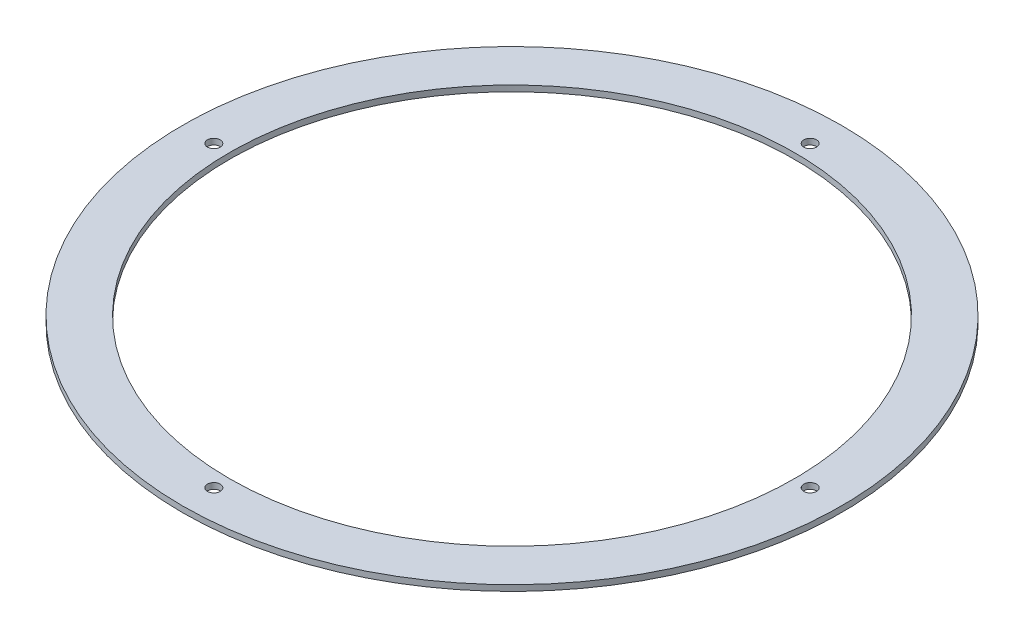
ISO-10303-21;
HEADER;
FILE_DESCRIPTION(('STEP AP214'),'2;1');
FILE_NAME('part.step','',(''),(''),'','','');
FILE_SCHEMA(('AUTOMOTIVE_DESIGN { 1 0 10303 214 1 1 1 1 }'));
ENDSEC;
DATA;
#1=APPLICATION_CONTEXT('core data for automotive mechanical design processes');
#2=APPLICATION_PROTOCOL_DEFINITION('international standard','automotive_design',2000,#1);
#3=PRODUCT_CONTEXT('',#1,'mechanical');
#4=PRODUCT('Part','Part','',(#3));
#5=PRODUCT_RELATED_PRODUCT_CATEGORY('part','',(#4));
#6=PRODUCT_DEFINITION_FORMATION('','',#4);
#7=PRODUCT_DEFINITION_CONTEXT('part definition',#1,'design');
#8=PRODUCT_DEFINITION('design','',#6,#7);
#9=PRODUCT_DEFINITION_SHAPE('','',#8);
#10=(LENGTH_UNIT() NAMED_UNIT(*) SI_UNIT(.MILLI.,.METRE.));
#11=(NAMED_UNIT(*) PLANE_ANGLE_UNIT() SI_UNIT($,.RADIAN.));
#12=(NAMED_UNIT(*) SI_UNIT($,.STERADIAN.) SOLID_ANGLE_UNIT());
#13=UNCERTAINTY_MEASURE_WITH_UNIT(LENGTH_MEASURE(1.E-05),#10,'distance_accuracy_value','');
#14=(GEOMETRIC_REPRESENTATION_CONTEXT(3) GLOBAL_UNCERTAINTY_ASSIGNED_CONTEXT((#13)) GLOBAL_UNIT_ASSIGNED_CONTEXT((#10,
#11,#12)) REPRESENTATION_CONTEXT('',''));
#15=CARTESIAN_POINT('',(0.,0.,0.));
#16=DIRECTION('',(0.,0.,1.));
#17=DIRECTION('',(1.,0.,0.));
#18=AXIS2_PLACEMENT_3D('',#15,#16,#17);
#19=CARTESIAN_POINT('',(0.,-9.525,0.));
#20=DIRECTION('',(0.,1.,0.));
#21=DIRECTION('',(0.,0.,1.));
#22=AXIS2_PLACEMENT_3D('',#19,#20,#21);
#23=CYLINDRICAL_SURFACE('',#22,533.4);
#24=CARTESIAN_POINT('',(0.,-9.525,0.));
#25=DIRECTION('',(0.,1.,0.));
#26=DIRECTION('',(0.,0.,1.));
#27=AXIS2_PLACEMENT_3D('',#24,#25,#26);
#28=CIRCLE('',#27,533.4);
#29=CARTESIAN_POINT('',(0.,-9.525,533.4));
#30=VERTEX_POINT('',#29);
#31=EDGE_CURVE('E10',#30,#30,#28,.T.);
#32=CARTESIAN_POINT('',(0.,0.,0.));
#33=DIRECTION('',(0.,1.,0.));
#34=DIRECTION('',(0.,0.,1.));
#35=AXIS2_PLACEMENT_3D('',#32,#33,#34);
#36=CIRCLE('',#35,533.4);
#37=CARTESIAN_POINT('',(0.,0.,533.4));
#38=VERTEX_POINT('',#37);
#39=EDGE_CURVE('E35',#38,#38,#36,.T.);
#40=CARTESIAN_POINT('',(0.,-9.525,533.4));
#41=CARTESIAN_POINT('',(0.,-9.42578125,533.4));
#42=CARTESIAN_POINT('',(0.,-9.3265625,533.4));
#43=CARTESIAN_POINT('',(0.,-9.128125,533.4));
#44=CARTESIAN_POINT('',(0.,-9.02890625,533.4));
#45=CARTESIAN_POINT('',(0.,-8.83046875,533.4));
#46=CARTESIAN_POINT('',(0.,-8.73125,533.4));
#47=CARTESIAN_POINT('',(0.,-8.5328125,533.4));
#48=CARTESIAN_POINT('',(0.,-8.43359375,533.4));
#49=CARTESIAN_POINT('',(0.,-8.23515625,533.4));
#50=CARTESIAN_POINT('',(0.,-8.1359375,533.4));
#51=CARTESIAN_POINT('',(0.,-7.9375,533.4));
#52=CARTESIAN_POINT('',(0.,-7.83828125,533.4));
#53=CARTESIAN_POINT('',(0.,-7.63984375,533.4));
#54=CARTESIAN_POINT('',(0.,-7.540625,533.4));
#55=CARTESIAN_POINT('',(0.,-7.3421875,533.4));
#56=CARTESIAN_POINT('',(0.,-7.24296875,533.4));
#57=CARTESIAN_POINT('',(0.,-7.04453125,533.4));
#58=CARTESIAN_POINT('',(0.,-6.9453125,533.4));
#59=CARTESIAN_POINT('',(0.,-6.746875,533.4));
#60=CARTESIAN_POINT('',(0.,-6.64765625,533.4));
#61=CARTESIAN_POINT('',(0.,-6.44921875,533.4));
#62=CARTESIAN_POINT('',(0.,-6.35,533.4));
#63=CARTESIAN_POINT('',(0.,-6.1515625,533.4));
#64=CARTESIAN_POINT('',(0.,-6.05234375,533.4));
#65=CARTESIAN_POINT('',(0.,-5.85390625,533.4));
#66=CARTESIAN_POINT('',(0.,-5.7546875,533.4));
#67=CARTESIAN_POINT('',(0.,-5.55625,533.4));
#68=CARTESIAN_POINT('',(0.,-5.45703125,533.4));
#69=CARTESIAN_POINT('',(0.,-5.25859375,533.4));
#70=CARTESIAN_POINT('',(0.,-5.159375,533.4));
#71=CARTESIAN_POINT('',(0.,-4.9609375,533.4));
#72=CARTESIAN_POINT('',(0.,-4.86171875,533.4));
#73=CARTESIAN_POINT('',(0.,-4.66328125,533.4));
#74=CARTESIAN_POINT('',(0.,-4.5640625,533.4));
#75=CARTESIAN_POINT('',(0.,-4.365625,533.4));
#76=CARTESIAN_POINT('',(0.,-4.26640625,533.4));
#77=CARTESIAN_POINT('',(0.,-4.06796875,533.4));
#78=CARTESIAN_POINT('',(0.,-3.96875,533.4));
#79=CARTESIAN_POINT('',(0.,-3.7703125,533.4));
#80=CARTESIAN_POINT('',(0.,-3.67109375,533.4));
#81=CARTESIAN_POINT('',(0.,-3.47265625,533.4));
#82=CARTESIAN_POINT('',(0.,-3.3734375,533.4));
#83=CARTESIAN_POINT('',(0.,-3.175,533.4));
#84=CARTESIAN_POINT('',(0.,-3.07578125,533.4));
#85=CARTESIAN_POINT('',(0.,-2.87734375,533.4));
#86=CARTESIAN_POINT('',(0.,-2.778125,533.4));
#87=CARTESIAN_POINT('',(0.,-2.5796875,533.4));
#88=CARTESIAN_POINT('',(0.,-2.48046875,533.4));
#89=CARTESIAN_POINT('',(0.,-2.28203125,533.4));
#90=CARTESIAN_POINT('',(0.,-2.1828125,533.4));
#91=CARTESIAN_POINT('',(0.,-1.984375,533.4));
#92=CARTESIAN_POINT('',(0.,-1.88515625,533.4));
#93=CARTESIAN_POINT('',(0.,-1.68671875,533.4));
#94=CARTESIAN_POINT('',(0.,-1.5875,533.4));
#95=CARTESIAN_POINT('',(0.,-1.3890625,533.4));
#96=CARTESIAN_POINT('',(0.,-1.28984375,533.4));
#97=CARTESIAN_POINT('',(0.,-1.09140625,533.4));
#98=CARTESIAN_POINT('',(0.,-0.992187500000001,533.4));
#99=CARTESIAN_POINT('',(0.,-0.793750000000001,533.4));
#100=CARTESIAN_POINT('',(0.,-0.69453125,533.4));
#101=CARTESIAN_POINT('',(0.,-0.49609375,533.4));
#102=CARTESIAN_POINT('',(0.,-0.396875,533.4));
#103=CARTESIAN_POINT('',(0.,-0.1984375,533.4));
#104=CARTESIAN_POINT('',(0.,-0.0992187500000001,533.4));
#105=CARTESIAN_POINT('',(0.,0.,533.4));
#106=B_SPLINE_CURVE_WITH_KNOTS('',3,(#40,#41,#42,#43,#44,#45,#46,#47,#48,#49,#50,#51,#52,#53,
#54,#55,#56,#57,#58,#59,#60,#61,#62,#63,#64,#65,#66,#67,#68,#69,#70,#71,#72,#73,#74,#75,#76,#77,
#78,#79,#80,#81,#82,#83,#84,#85,#86,#87,#88,#89,#90,#91,#92,#93,#94,#95,#96,#97,#98,#99,#100,
#101,#102,#103,#104,#105),.UNSPECIFIED.,.F.,.F.,(4,2,2,2,2,2,2,2,2,2,2,2,2,2,2,2,2,2,2,2,2,2,2,
2,2,2,2,2,2,2,2,2,4),(0.,0.29765625,0.5953125,0.892968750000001,1.190625,1.48828125,1.7859375,
2.08359375,2.38125,2.67890625,2.9765625,3.27421875,3.571875,3.86953125,4.1671875,4.46484375,
4.7625,5.06015625,5.3578125,5.65546875,5.953125,6.25078125,6.5484375,6.84609375,7.14375,
7.44140625,7.7390625,8.03671875,8.334375,8.63203125,8.9296875,9.22734375,9.525),.UNSPECIFIED.);
#107=EDGE_CURVE('BSEAM29',#30,#38,#106,.T.);
#108=ORIENTED_EDGE('',*,*,#31,.T.);
#109=ORIENTED_EDGE('',*,*,#39,.F.);
#110=ORIENTED_EDGE('',*,*,#107,.T.);
#111=ORIENTED_EDGE('',*,*,#107,.F.);
#112=EDGE_LOOP('',(#108,#110,#109,#111));
#113=FACE_BOUND('',#112,.T.);
#114=ADVANCED_FACE('F29',(#113),#23,.T.);
#115=CARTESIAN_POINT('',(0.,-9.525,0.));
#116=DIRECTION('',(0.,1.,0.));
#117=DIRECTION('',(0.,0.,1.));
#118=AXIS2_PLACEMENT_3D('',#115,#116,#117);
#119=PLANE('',#118);
#120=CARTESIAN_POINT('',(482.6,-9.525,-5.05496961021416E-12));
#121=DIRECTION('',(0.,1.,0.));
#122=DIRECTION('',(-1.,0.,0.));
#123=AXIS2_PLACEMENT_3D('',#120,#121,#122);
#124=CIRCLE('',#123,10.3124);
#125=CARTESIAN_POINT('',(482.6,-9.525,10.3123999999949));
#126=VERTEX_POINT('',#125);
#127=EDGE_CURVE('E66',#126,#126,#124,.T.);
#128=ORIENTED_EDGE('',*,*,#127,.T.);
#129=EDGE_LOOP('',(#128));
#130=FACE_BOUND('',#129,.T.);
#131=CARTESIAN_POINT('',(3.36997974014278E-12,-9.525,482.6));
#132=DIRECTION('',(0.,1.,0.));
#133=DIRECTION('',(0.,0.,-1.));
#134=AXIS2_PLACEMENT_3D('',#131,#132,#133);
#135=CIRCLE('',#134,10.3124);
#136=CARTESIAN_POINT('',(3.36997974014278E-12,-9.525,492.9124));
#137=VERTEX_POINT('',#136);
#138=EDGE_CURVE('E60',#137,#137,#135,.T.);
#139=ORIENTED_EDGE('',*,*,#138,.T.);
#140=EDGE_LOOP('',(#139));
#141=FACE_BOUND('',#140,.T.);
#142=CARTESIAN_POINT('',(-482.6,-9.525,1.68498987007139E-12));
#143=DIRECTION('',(0.,1.,0.));
#144=DIRECTION('',(1.,0.,0.));
#145=AXIS2_PLACEMENT_3D('',#142,#143,#144);
#146=CIRCLE('',#145,10.3124);
#147=CARTESIAN_POINT('',(-482.6,-9.525,10.3124000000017));
#148=VERTEX_POINT('',#147);
#149=EDGE_CURVE('E54',#148,#148,#146,.T.);
#150=ORIENTED_EDGE('',*,*,#149,.T.);
#151=EDGE_LOOP('',(#150));
#152=FACE_BOUND('',#151,.T.);
#153=CARTESIAN_POINT('',(0.,-9.525,-482.6));
#154=DIRECTION('',(0.,1.,0.));
#155=DIRECTION('',(0.,0.,1.));
#156=AXIS2_PLACEMENT_3D('',#153,#154,#155);
#157=CIRCLE('',#156,10.3124);
#158=CARTESIAN_POINT('',(0.,-9.525,-472.2876));
#159=VERTEX_POINT('',#158);
#160=EDGE_CURVE('E48',#159,#159,#157,.T.);
#161=ORIENTED_EDGE('',*,*,#160,.T.);
#162=EDGE_LOOP('',(#161));
#163=FACE_BOUND('',#162,.T.);
#164=CARTESIAN_POINT('',(0.,-9.525,0.));
#165=DIRECTION('',(0.,1.,0.));
#166=DIRECTION('',(0.,0.,1.));
#167=AXIS2_PLACEMENT_3D('',#164,#165,#166);
#168=CIRCLE('',#167,457.2);
#169=CARTESIAN_POINT('',(0.,-9.525,457.2));
#170=VERTEX_POINT('',#169);
#171=EDGE_CURVE('E39',#170,#170,#168,.T.);
#172=ORIENTED_EDGE('',*,*,#171,.T.);
#173=EDGE_LOOP('',(#172));
#174=FACE_BOUND('',#173,.T.);
#175=ORIENTED_EDGE('',*,*,#31,.F.);
#176=EDGE_LOOP('',(#175));
#177=FACE_BOUND('',#176,.T.);
#178=ADVANCED_FACE('F79',(#130,#141,#152,#163,#174,#177),#119,.F.);
#179=CARTESIAN_POINT('',(0.,0.,0.));
#180=DIRECTION('',(0.,1.,0.));
#181=DIRECTION('',(0.,0.,1.));
#182=AXIS2_PLACEMENT_3D('',#179,#180,#181);
#183=PLANE('',#182);
#184=CARTESIAN_POINT('',(482.6,0.,-5.05496961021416E-12));
#185=DIRECTION('',(0.,1.,0.));
#186=DIRECTION('',(-1.,0.,0.));
#187=AXIS2_PLACEMENT_3D('',#184,#185,#186);
#188=CIRCLE('',#187,10.3124);
#189=CARTESIAN_POINT('',(482.6,0.,10.3123999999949));
#190=VERTEX_POINT('',#189);
#191=EDGE_CURVE('E69',#190,#190,#188,.T.);
#192=ORIENTED_EDGE('',*,*,#191,.F.);
#193=EDGE_LOOP('',(#192));
#194=FACE_BOUND('',#193,.T.);
#195=CARTESIAN_POINT('',(3.36997974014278E-12,0.,482.6));
#196=DIRECTION('',(0.,1.,0.));
#197=DIRECTION('',(0.,0.,-1.));
#198=AXIS2_PLACEMENT_3D('',#195,#196,#197);
#199=CIRCLE('',#198,10.3124);
#200=CARTESIAN_POINT('',(3.36997974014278E-12,0.,492.9124));
#201=VERTEX_POINT('',#200);
#202=EDGE_CURVE('E63',#201,#201,#199,.T.);
#203=ORIENTED_EDGE('',*,*,#202,.F.);
#204=EDGE_LOOP('',(#203));
#205=FACE_BOUND('',#204,.T.);
#206=CARTESIAN_POINT('',(-482.6,0.,1.68498987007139E-12));
#207=DIRECTION('',(0.,1.,0.));
#208=DIRECTION('',(1.,0.,0.));
#209=AXIS2_PLACEMENT_3D('',#206,#207,#208);
#210=CIRCLE('',#209,10.3124);
#211=CARTESIAN_POINT('',(-482.6,0.,10.3124000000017));
#212=VERTEX_POINT('',#211);
#213=EDGE_CURVE('E57',#212,#212,#210,.T.);
#214=ORIENTED_EDGE('',*,*,#213,.F.);
#215=EDGE_LOOP('',(#214));
#216=FACE_BOUND('',#215,.T.);
#217=CARTESIAN_POINT('',(0.,0.,-482.6));
#218=DIRECTION('',(0.,1.,0.));
#219=DIRECTION('',(0.,0.,1.));
#220=AXIS2_PLACEMENT_3D('',#217,#218,#219);
#221=CIRCLE('',#220,10.3124);
#222=CARTESIAN_POINT('',(0.,0.,-472.2876));
#223=VERTEX_POINT('',#222);
#224=EDGE_CURVE('E51',#223,#223,#221,.T.);
#225=ORIENTED_EDGE('',*,*,#224,.F.);
#226=EDGE_LOOP('',(#225));
#227=FACE_BOUND('',#226,.T.);
#228=CARTESIAN_POINT('',(0.,0.,0.));
#229=DIRECTION('',(0.,1.,0.));
#230=DIRECTION('',(0.,0.,1.));
#231=AXIS2_PLACEMENT_3D('',#228,#229,#230);
#232=CIRCLE('',#231,457.2);
#233=CARTESIAN_POINT('',(0.,0.,457.2));
#234=VERTEX_POINT('',#233);
#235=EDGE_CURVE('E43',#234,#234,#232,.T.);
#236=ORIENTED_EDGE('',*,*,#235,.F.);
#237=EDGE_LOOP('',(#236));
#238=FACE_BOUND('',#237,.T.);
#239=ORIENTED_EDGE('',*,*,#39,.T.);
#240=EDGE_LOOP('',(#239));
#241=FACE_BOUND('',#240,.T.);
#242=ADVANCED_FACE('F75',(#194,#205,#216,#227,#238,#241),#183,.T.);
#243=CARTESIAN_POINT('',(0.,-9.525,0.));
#244=DIRECTION('',(0.,1.,0.));
#245=DIRECTION('',(0.,0.,1.));
#246=AXIS2_PLACEMENT_3D('',#243,#244,#245);
#247=CYLINDRICAL_SURFACE('',#246,457.2);
#248=CARTESIAN_POINT('',(0.,-9.525,457.2));
#249=CARTESIAN_POINT('',(0.,-9.42578125,457.2));
#250=CARTESIAN_POINT('',(0.,-9.3265625,457.2));
#251=CARTESIAN_POINT('',(0.,-9.128125,457.2));
#252=CARTESIAN_POINT('',(0.,-9.02890625,457.2));
#253=CARTESIAN_POINT('',(0.,-8.83046875,457.2));
#254=CARTESIAN_POINT('',(0.,-8.73125,457.2));
#255=CARTESIAN_POINT('',(0.,-8.5328125,457.2));
#256=CARTESIAN_POINT('',(0.,-8.43359375,457.2));
#257=CARTESIAN_POINT('',(0.,-8.23515625,457.2));
#258=CARTESIAN_POINT('',(0.,-8.1359375,457.2));
#259=CARTESIAN_POINT('',(0.,-7.9375,457.2));
#260=CARTESIAN_POINT('',(0.,-7.83828125,457.2));
#261=CARTESIAN_POINT('',(0.,-7.63984375,457.2));
#262=CARTESIAN_POINT('',(0.,-7.540625,457.2));
#263=CARTESIAN_POINT('',(0.,-7.3421875,457.2));
#264=CARTESIAN_POINT('',(0.,-7.24296875,457.2));
#265=CARTESIAN_POINT('',(0.,-7.04453125,457.2));
#266=CARTESIAN_POINT('',(0.,-6.9453125,457.2));
#267=CARTESIAN_POINT('',(0.,-6.746875,457.2));
#268=CARTESIAN_POINT('',(0.,-6.64765625,457.2));
#269=CARTESIAN_POINT('',(0.,-6.44921875,457.2));
#270=CARTESIAN_POINT('',(0.,-6.35,457.2));
#271=CARTESIAN_POINT('',(0.,-6.1515625,457.2));
#272=CARTESIAN_POINT('',(0.,-6.05234375,457.2));
#273=CARTESIAN_POINT('',(0.,-5.85390625,457.2));
#274=CARTESIAN_POINT('',(0.,-5.7546875,457.2));
#275=CARTESIAN_POINT('',(0.,-5.55625,457.2));
#276=CARTESIAN_POINT('',(0.,-5.45703125,457.2));
#277=CARTESIAN_POINT('',(0.,-5.25859375,457.2));
#278=CARTESIAN_POINT('',(0.,-5.159375,457.2));
#279=CARTESIAN_POINT('',(0.,-4.9609375,457.2));
#280=CARTESIAN_POINT('',(0.,-4.86171875,457.2));
#281=CARTESIAN_POINT('',(0.,-4.66328125,457.2));
#282=CARTESIAN_POINT('',(0.,-4.5640625,457.2));
#283=CARTESIAN_POINT('',(0.,-4.365625,457.2));
#284=CARTESIAN_POINT('',(0.,-4.26640625,457.2));
#285=CARTESIAN_POINT('',(0.,-4.06796875,457.2));
#286=CARTESIAN_POINT('',(0.,-3.96875,457.2));
#287=CARTESIAN_POINT('',(0.,-3.7703125,457.2));
#288=CARTESIAN_POINT('',(0.,-3.67109375,457.2));
#289=CARTESIAN_POINT('',(0.,-3.47265625,457.2));
#290=CARTESIAN_POINT('',(0.,-3.3734375,457.2));
#291=CARTESIAN_POINT('',(0.,-3.175,457.2));
#292=CARTESIAN_POINT('',(0.,-3.07578125,457.2));
#293=CARTESIAN_POINT('',(0.,-2.87734375,457.2));
#294=CARTESIAN_POINT('',(0.,-2.778125,457.2));
#295=CARTESIAN_POINT('',(0.,-2.5796875,457.2));
#296=CARTESIAN_POINT('',(0.,-2.48046875,457.2));
#297=CARTESIAN_POINT('',(0.,-2.28203125,457.2));
#298=CARTESIAN_POINT('',(0.,-2.1828125,457.2));
#299=CARTESIAN_POINT('',(0.,-1.984375,457.2));
#300=CARTESIAN_POINT('',(0.,-1.88515625,457.2));
#301=CARTESIAN_POINT('',(0.,-1.68671875,457.2));
#302=CARTESIAN_POINT('',(0.,-1.5875,457.2));
#303=CARTESIAN_POINT('',(0.,-1.3890625,457.2));
#304=CARTESIAN_POINT('',(0.,-1.28984375,457.2));
#305=CARTESIAN_POINT('',(0.,-1.09140625,457.2));
#306=CARTESIAN_POINT('',(0.,-0.992187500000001,457.2));
#307=CARTESIAN_POINT('',(0.,-0.793750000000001,457.2));
#308=CARTESIAN_POINT('',(0.,-0.69453125,457.2));
#309=CARTESIAN_POINT('',(0.,-0.49609375,457.2));
#310=CARTESIAN_POINT('',(0.,-0.396875,457.2));
#311=CARTESIAN_POINT('',(0.,-0.1984375,457.2));
#312=CARTESIAN_POINT('',(0.,-0.0992187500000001,457.2));
#313=CARTESIAN_POINT('',(0.,0.,457.2));
#314=B_SPLINE_CURVE_WITH_KNOTS('',3,(#248,#249,#250,#251,#252,#253,#254,#255,#256,#257,#258,
#259,#260,#261,#262,#263,#264,#265,#266,#267,#268,#269,#270,#271,#272,#273,#274,#275,#276,#277,
#278,#279,#280,#281,#282,#283,#284,#285,#286,#287,#288,#289,#290,#291,#292,#293,#294,#295,#296,
#297,#298,#299,#300,#301,#302,#303,#304,#305,#306,#307,#308,#309,#310,#311,#312,#313),
.UNSPECIFIED.,.F.,.F.,(4,2,2,2,2,2,2,2,2,2,2,2,2,2,2,2,2,2,2,2,2,2,2,2,2,2,2,2,2,2,2,2,4),(0.,
0.297656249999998,0.595312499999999,0.892968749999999,1.190625,1.48828125,1.7859375,2.08359375,
2.38125,2.67890625,2.9765625,3.27421875,3.571875,3.86953125,4.1671875,4.46484375,4.7625,
5.06015625,5.3578125,5.65546875,5.953125,6.25078125,6.5484375,6.84609375,7.14375,7.44140625,
7.7390625,8.03671875,8.334375,8.63203125,8.9296875,9.22734375,9.525),.UNSPECIFIED.);
#315=EDGE_CURVE('BSEAM78',#170,#234,#314,.T.);
#316=ORIENTED_EDGE('',*,*,#171,.F.);
#317=ORIENTED_EDGE('',*,*,#235,.T.);
#318=ORIENTED_EDGE('',*,*,#315,.T.);
#319=ORIENTED_EDGE('',*,*,#315,.F.);
#320=EDGE_LOOP('',(#316,#318,#317,#319));
#321=FACE_BOUND('',#320,.T.);
#322=ADVANCED_FACE('F78',(#321),#247,.F.);
#323=CARTESIAN_POINT('',(0.,-9.525,-482.6));
#324=DIRECTION('',(0.,1.,0.));
#325=DIRECTION('',(0.,0.,1.));
#326=AXIS2_PLACEMENT_3D('',#323,#324,#325);
#327=CYLINDRICAL_SURFACE('',#326,10.3124);
#328=CARTESIAN_POINT('',(0.,-9.525,-472.2876));
#329=CARTESIAN_POINT('',(0.,-9.42578125,-472.2876));
#330=CARTESIAN_POINT('',(0.,-9.3265625,-472.2876));
#331=CARTESIAN_POINT('',(0.,-9.128125,-472.2876));
#332=CARTESIAN_POINT('',(0.,-9.02890625,-472.2876));
#333=CARTESIAN_POINT('',(0.,-8.83046875,-472.2876));
#334=CARTESIAN_POINT('',(0.,-8.73125,-472.2876));
#335=CARTESIAN_POINT('',(0.,-8.5328125,-472.2876));
#336=CARTESIAN_POINT('',(0.,-8.43359375,-472.2876));
#337=CARTESIAN_POINT('',(0.,-8.23515625,-472.2876));
#338=CARTESIAN_POINT('',(0.,-8.1359375,-472.2876));
#339=CARTESIAN_POINT('',(0.,-7.9375,-472.2876));
#340=CARTESIAN_POINT('',(0.,-7.83828125,-472.2876));
#341=CARTESIAN_POINT('',(0.,-7.63984375,-472.2876));
#342=CARTESIAN_POINT('',(0.,-7.540625,-472.2876));
#343=CARTESIAN_POINT('',(0.,-7.3421875,-472.2876));
#344=CARTESIAN_POINT('',(0.,-7.24296875,-472.2876));
#345=CARTESIAN_POINT('',(0.,-7.04453125,-472.2876));
#346=CARTESIAN_POINT('',(0.,-6.9453125,-472.2876));
#347=CARTESIAN_POINT('',(0.,-6.746875,-472.2876));
#348=CARTESIAN_POINT('',(0.,-6.64765625,-472.2876));
#349=CARTESIAN_POINT('',(0.,-6.44921875,-472.2876));
#350=CARTESIAN_POINT('',(0.,-6.35,-472.2876));
#351=CARTESIAN_POINT('',(0.,-6.1515625,-472.2876));
#352=CARTESIAN_POINT('',(0.,-6.05234375,-472.2876));
#353=CARTESIAN_POINT('',(0.,-5.85390625,-472.2876));
#354=CARTESIAN_POINT('',(0.,-5.7546875,-472.2876));
#355=CARTESIAN_POINT('',(0.,-5.55625,-472.2876));
#356=CARTESIAN_POINT('',(0.,-5.45703125,-472.2876));
#357=CARTESIAN_POINT('',(0.,-5.25859375,-472.2876));
#358=CARTESIAN_POINT('',(0.,-5.159375,-472.2876));
#359=CARTESIAN_POINT('',(0.,-4.9609375,-472.2876));
#360=CARTESIAN_POINT('',(0.,-4.86171875,-472.2876));
#361=CARTESIAN_POINT('',(0.,-4.66328125,-472.2876));
#362=CARTESIAN_POINT('',(0.,-4.5640625,-472.2876));
#363=CARTESIAN_POINT('',(0.,-4.365625,-472.2876));
#364=CARTESIAN_POINT('',(0.,-4.26640625,-472.2876));
#365=CARTESIAN_POINT('',(0.,-4.06796875,-472.2876));
#366=CARTESIAN_POINT('',(0.,-3.96875,-472.2876));
#367=CARTESIAN_POINT('',(0.,-3.7703125,-472.2876));
#368=CARTESIAN_POINT('',(0.,-3.67109375,-472.2876));
#369=CARTESIAN_POINT('',(0.,-3.47265625,-472.2876));
#370=CARTESIAN_POINT('',(0.,-3.3734375,-472.2876));
#371=CARTESIAN_POINT('',(0.,-3.175,-472.2876));
#372=CARTESIAN_POINT('',(0.,-3.07578125,-472.2876));
#373=CARTESIAN_POINT('',(0.,-2.87734375,-472.2876));
#374=CARTESIAN_POINT('',(0.,-2.778125,-472.2876));
#375=CARTESIAN_POINT('',(0.,-2.5796875,-472.2876));
#376=CARTESIAN_POINT('',(0.,-2.48046875,-472.2876));
#377=CARTESIAN_POINT('',(0.,-2.28203125,-472.2876));
#378=CARTESIAN_POINT('',(0.,-2.1828125,-472.2876));
#379=CARTESIAN_POINT('',(0.,-1.984375,-472.2876));
#380=CARTESIAN_POINT('',(0.,-1.88515625,-472.2876));
#381=CARTESIAN_POINT('',(0.,-1.68671875,-472.2876));
#382=CARTESIAN_POINT('',(0.,-1.5875,-472.2876));
#383=CARTESIAN_POINT('',(0.,-1.3890625,-472.2876));
#384=CARTESIAN_POINT('',(0.,-1.28984375,-472.2876));
#385=CARTESIAN_POINT('',(0.,-1.09140625,-472.2876));
#386=CARTESIAN_POINT('',(0.,-0.992187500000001,-472.2876));
#387=CARTESIAN_POINT('',(0.,-0.793750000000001,-472.2876));
#388=CARTESIAN_POINT('',(0.,-0.69453125,-472.2876));
#389=CARTESIAN_POINT('',(0.,-0.49609375,-472.2876));
#390=CARTESIAN_POINT('',(0.,-0.396875,-472.2876));
#391=CARTESIAN_POINT('',(0.,-0.1984375,-472.2876));
#392=CARTESIAN_POINT('',(0.,-0.0992187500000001,-472.2876));
#393=CARTESIAN_POINT('',(0.,0.,-472.2876));
#394=B_SPLINE_CURVE_WITH_KNOTS('',3,(#328,#329,#330,#331,#332,#333,#334,#335,#336,#337,#338,
#339,#340,#341,#342,#343,#344,#345,#346,#347,#348,#349,#350,#351,#352,#353,#354,#355,#356,#357,
#358,#359,#360,#361,#362,#363,#364,#365,#366,#367,#368,#369,#370,#371,#372,#373,#374,#375,#376,
#377,#378,#379,#380,#381,#382,#383,#384,#385,#386,#387,#388,#389,#390,#391,#392,#393),
.UNSPECIFIED.,.F.,.F.,(4,2,2,2,2,2,2,2,2,2,2,2,2,2,2,2,2,2,2,2,2,2,2,2,2,2,2,2,2,2,2,2,4),(0.,
0.29765625,0.5953125,0.892968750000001,1.190625,1.48828125,1.7859375,2.08359375,2.38125,
2.67890625,2.9765625,3.27421875,3.571875,3.86953125,4.1671875,4.46484375,4.7625,5.06015625,
5.3578125,5.65546875,5.953125,6.25078125,6.5484375,6.84609375,7.14375,7.44140625,7.7390625,
8.03671875,8.334375,8.63203125,8.9296875,9.22734375,9.525),.UNSPECIFIED.);
#395=EDGE_CURVE('BSEAM90',#159,#223,#394,.T.);
#396=ORIENTED_EDGE('',*,*,#160,.F.);
#397=ORIENTED_EDGE('',*,*,#224,.T.);
#398=ORIENTED_EDGE('',*,*,#395,.T.);
#399=ORIENTED_EDGE('',*,*,#395,.F.);
#400=EDGE_LOOP('',(#396,#398,#397,#399));
#401=FACE_BOUND('',#400,.T.);
#402=ADVANCED_FACE('F90',(#401),#327,.F.);
#403=CARTESIAN_POINT('',(-482.6,-9.525,1.68498987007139E-12));
#404=DIRECTION('',(0.,1.,0.));
#405=DIRECTION('',(0.,0.,1.));
#406=AXIS2_PLACEMENT_3D('',#403,#404,#405);
#407=CYLINDRICAL_SURFACE('',#406,10.3124);
#408=CARTESIAN_POINT('',(-482.6,-9.525,10.3124000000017));
#409=CARTESIAN_POINT('',(-482.6,-9.42578125,10.3124000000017));
#410=CARTESIAN_POINT('',(-482.6,-9.3265625,10.3124000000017));
#411=CARTESIAN_POINT('',(-482.6,-9.128125,10.3124000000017));
#412=CARTESIAN_POINT('',(-482.6,-9.02890625,10.3124000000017));
#413=CARTESIAN_POINT('',(-482.6,-8.83046875,10.3124000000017));
#414=CARTESIAN_POINT('',(-482.6,-8.73125,10.3124000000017));
#415=CARTESIAN_POINT('',(-482.6,-8.5328125,10.3124000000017));
#416=CARTESIAN_POINT('',(-482.6,-8.43359375,10.3124000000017));
#417=CARTESIAN_POINT('',(-482.6,-8.23515625,10.3124000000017));
#418=CARTESIAN_POINT('',(-482.6,-8.1359375,10.3124000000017));
#419=CARTESIAN_POINT('',(-482.6,-7.9375,10.3124000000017));
#420=CARTESIAN_POINT('',(-482.6,-7.83828125,10.3124000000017));
#421=CARTESIAN_POINT('',(-482.6,-7.63984375,10.3124000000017));
#422=CARTESIAN_POINT('',(-482.6,-7.540625,10.3124000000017));
#423=CARTESIAN_POINT('',(-482.6,-7.3421875,10.3124000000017));
#424=CARTESIAN_POINT('',(-482.6,-7.24296875,10.3124000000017));
#425=CARTESIAN_POINT('',(-482.6,-7.04453125,10.3124000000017));
#426=CARTESIAN_POINT('',(-482.6,-6.9453125,10.3124000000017));
#427=CARTESIAN_POINT('',(-482.6,-6.746875,10.3124000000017));
#428=CARTESIAN_POINT('',(-482.6,-6.64765625,10.3124000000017));
#429=CARTESIAN_POINT('',(-482.6,-6.44921875,10.3124000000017));
#430=CARTESIAN_POINT('',(-482.6,-6.35,10.3124000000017));
#431=CARTESIAN_POINT('',(-482.6,-6.1515625,10.3124000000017));
#432=CARTESIAN_POINT('',(-482.6,-6.05234375,10.3124000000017));
#433=CARTESIAN_POINT('',(-482.6,-5.85390625,10.3124000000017));
#434=CARTESIAN_POINT('',(-482.6,-5.7546875,10.3124000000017));
#435=CARTESIAN_POINT('',(-482.6,-5.55625,10.3124000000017));
#436=CARTESIAN_POINT('',(-482.6,-5.45703125,10.3124000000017));
#437=CARTESIAN_POINT('',(-482.6,-5.25859375,10.3124000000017));
#438=CARTESIAN_POINT('',(-482.6,-5.159375,10.3124000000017));
#439=CARTESIAN_POINT('',(-482.6,-4.9609375,10.3124000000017));
#440=CARTESIAN_POINT('',(-482.6,-4.86171875,10.3124000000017));
#441=CARTESIAN_POINT('',(-482.6,-4.66328125,10.3124000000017));
#442=CARTESIAN_POINT('',(-482.6,-4.5640625,10.3124000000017));
#443=CARTESIAN_POINT('',(-482.6,-4.365625,10.3124000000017));
#444=CARTESIAN_POINT('',(-482.6,-4.26640625,10.3124000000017));
#445=CARTESIAN_POINT('',(-482.6,-4.06796875,10.3124000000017));
#446=CARTESIAN_POINT('',(-482.6,-3.96875,10.3124000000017));
#447=CARTESIAN_POINT('',(-482.6,-3.7703125,10.3124000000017));
#448=CARTESIAN_POINT('',(-482.6,-3.67109375,10.3124000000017));
#449=CARTESIAN_POINT('',(-482.6,-3.47265625,10.3124000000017));
#450=CARTESIAN_POINT('',(-482.6,-3.3734375,10.3124000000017));
#451=CARTESIAN_POINT('',(-482.6,-3.175,10.3124000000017));
#452=CARTESIAN_POINT('',(-482.6,-3.07578125,10.3124000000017));
#453=CARTESIAN_POINT('',(-482.6,-2.87734375,10.3124000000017));
#454=CARTESIAN_POINT('',(-482.6,-2.778125,10.3124000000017));
#455=CARTESIAN_POINT('',(-482.6,-2.5796875,10.3124000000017));
#456=CARTESIAN_POINT('',(-482.6,-2.48046875,10.3124000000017));
#457=CARTESIAN_POINT('',(-482.6,-2.28203125,10.3124000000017));
#458=CARTESIAN_POINT('',(-482.6,-2.1828125,10.3124000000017));
#459=CARTESIAN_POINT('',(-482.6,-1.984375,10.3124000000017));
#460=CARTESIAN_POINT('',(-482.6,-1.88515625,10.3124000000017));
#461=CARTESIAN_POINT('',(-482.6,-1.68671875,10.3124000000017));
#462=CARTESIAN_POINT('',(-482.6,-1.5875,10.3124000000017));
#463=CARTESIAN_POINT('',(-482.6,-1.3890625,10.3124000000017));
#464=CARTESIAN_POINT('',(-482.6,-1.28984375,10.3124000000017));
#465=CARTESIAN_POINT('',(-482.6,-1.09140625,10.3124000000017));
#466=CARTESIAN_POINT('',(-482.6,-0.992187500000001,10.3124000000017));
#467=CARTESIAN_POINT('',(-482.6,-0.793750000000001,10.3124000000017));
#468=CARTESIAN_POINT('',(-482.6,-0.69453125,10.3124000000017));
#469=CARTESIAN_POINT('',(-482.6,-0.49609375,10.3124000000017));
#470=CARTESIAN_POINT('',(-482.6,-0.396875,10.3124000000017));
#471=CARTESIAN_POINT('',(-482.6,-0.1984375,10.3124000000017));
#472=CARTESIAN_POINT('',(-482.6,-0.0992187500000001,10.3124000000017));
#473=CARTESIAN_POINT('',(-482.6,0.,10.3124000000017));
#474=B_SPLINE_CURVE_WITH_KNOTS('',3,(#408,#409,#410,#411,#412,#413,#414,#415,#416,#417,#418,
#419,#420,#421,#422,#423,#424,#425,#426,#427,#428,#429,#430,#431,#432,#433,#434,#435,#436,#437,
#438,#439,#440,#441,#442,#443,#444,#445,#446,#447,#448,#449,#450,#451,#452,#453,#454,#455,#456,
#457,#458,#459,#460,#461,#462,#463,#464,#465,#466,#467,#468,#469,#470,#471,#472,#473),
.UNSPECIFIED.,.F.,.F.,(4,2,2,2,2,2,2,2,2,2,2,2,2,2,2,2,2,2,2,2,2,2,2,2,2,2,2,2,2,2,2,2,4),(0.,
0.29765625,0.5953125,0.892968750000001,1.190625,1.48828125,1.7859375,2.08359375,2.38125,
2.67890625,2.9765625,3.27421875,3.571875,3.86953125,4.1671875,4.46484375,4.7625,5.06015625,
5.3578125,5.65546875,5.953125,6.25078125,6.5484375,6.84609375,7.14375,7.44140625,7.7390625,
8.03671875,8.334375,8.63203125,8.9296875,9.22734375,9.525),.UNSPECIFIED.);
#475=EDGE_CURVE('BSEAM97',#148,#212,#474,.T.);
#476=ORIENTED_EDGE('',*,*,#149,.F.);
#477=ORIENTED_EDGE('',*,*,#213,.T.);
#478=ORIENTED_EDGE('',*,*,#475,.T.);
#479=ORIENTED_EDGE('',*,*,#475,.F.);
#480=EDGE_LOOP('',(#476,#478,#477,#479));
#481=FACE_BOUND('',#480,.T.);
#482=ADVANCED_FACE('F97',(#481),#407,.F.);
#483=CARTESIAN_POINT('',(3.36997974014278E-12,-9.525,482.6));
#484=DIRECTION('',(0.,1.,0.));
#485=DIRECTION('',(0.,0.,1.));
#486=AXIS2_PLACEMENT_3D('',#483,#484,#485);
#487=CYLINDRICAL_SURFACE('',#486,10.3124);
#488=CARTESIAN_POINT('',(3.36997974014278E-12,-9.525,492.9124));
#489=CARTESIAN_POINT('',(3.36997974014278E-12,-9.42578125,492.9124));
#490=CARTESIAN_POINT('',(3.36997974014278E-12,-9.3265625,492.9124));
#491=CARTESIAN_POINT('',(3.36997974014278E-12,-9.128125,492.9124));
#492=CARTESIAN_POINT('',(3.36997974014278E-12,-9.02890625,492.9124));
#493=CARTESIAN_POINT('',(3.36997974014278E-12,-8.83046875,492.9124));
#494=CARTESIAN_POINT('',(3.36997974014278E-12,-8.73125,492.9124));
#495=CARTESIAN_POINT('',(3.36997974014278E-12,-8.5328125,492.9124));
#496=CARTESIAN_POINT('',(3.36997974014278E-12,-8.43359375,492.9124));
#497=CARTESIAN_POINT('',(3.36997974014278E-12,-8.23515625,492.9124));
#498=CARTESIAN_POINT('',(3.36997974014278E-12,-8.1359375,492.9124));
#499=CARTESIAN_POINT('',(3.36997974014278E-12,-7.9375,492.9124));
#500=CARTESIAN_POINT('',(3.36997974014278E-12,-7.83828125,492.9124));
#501=CARTESIAN_POINT('',(3.36997974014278E-12,-7.63984375,492.9124));
#502=CARTESIAN_POINT('',(3.36997974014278E-12,-7.540625,492.9124));
#503=CARTESIAN_POINT('',(3.36997974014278E-12,-7.3421875,492.9124));
#504=CARTESIAN_POINT('',(3.36997974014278E-12,-7.24296875,492.9124));
#505=CARTESIAN_POINT('',(3.36997974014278E-12,-7.04453125,492.9124));
#506=CARTESIAN_POINT('',(3.36997974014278E-12,-6.9453125,492.9124));
#507=CARTESIAN_POINT('',(3.36997974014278E-12,-6.746875,492.9124));
#508=CARTESIAN_POINT('',(3.36997974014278E-12,-6.64765625,492.9124));
#509=CARTESIAN_POINT('',(3.36997974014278E-12,-6.44921875,492.9124));
#510=CARTESIAN_POINT('',(3.36997974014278E-12,-6.35,492.9124));
#511=CARTESIAN_POINT('',(3.36997974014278E-12,-6.1515625,492.9124));
#512=CARTESIAN_POINT('',(3.36997974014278E-12,-6.05234375,492.9124));
#513=CARTESIAN_POINT('',(3.36997974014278E-12,-5.85390625,492.9124));
#514=CARTESIAN_POINT('',(3.36997974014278E-12,-5.7546875,492.9124));
#515=CARTESIAN_POINT('',(3.36997974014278E-12,-5.55625,492.9124));
#516=CARTESIAN_POINT('',(3.36997974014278E-12,-5.45703125,492.9124));
#517=CARTESIAN_POINT('',(3.36997974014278E-12,-5.25859375,492.9124));
#518=CARTESIAN_POINT('',(3.36997974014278E-12,-5.159375,492.9124));
#519=CARTESIAN_POINT('',(3.36997974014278E-12,-4.9609375,492.9124));
#520=CARTESIAN_POINT('',(3.36997974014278E-12,-4.86171875,492.9124));
#521=CARTESIAN_POINT('',(3.36997974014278E-12,-4.66328125,492.9124));
#522=CARTESIAN_POINT('',(3.36997974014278E-12,-4.5640625,492.9124));
#523=CARTESIAN_POINT('',(3.36997974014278E-12,-4.365625,492.9124));
#524=CARTESIAN_POINT('',(3.36997974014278E-12,-4.26640625,492.9124));
#525=CARTESIAN_POINT('',(3.36997974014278E-12,-4.06796875,492.9124));
#526=CARTESIAN_POINT('',(3.36997974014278E-12,-3.96875,492.9124));
#527=CARTESIAN_POINT('',(3.36997974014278E-12,-3.7703125,492.9124));
#528=CARTESIAN_POINT('',(3.36997974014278E-12,-3.67109375,492.9124));
#529=CARTESIAN_POINT('',(3.36997974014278E-12,-3.47265625,492.9124));
#530=CARTESIAN_POINT('',(3.36997974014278E-12,-3.3734375,492.9124));
#531=CARTESIAN_POINT('',(3.36997974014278E-12,-3.175,492.9124));
#532=CARTESIAN_POINT('',(3.36997974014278E-12,-3.07578125,492.9124));
#533=CARTESIAN_POINT('',(3.36997974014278E-12,-2.87734375,492.9124));
#534=CARTESIAN_POINT('',(3.36997974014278E-12,-2.778125,492.9124));
#535=CARTESIAN_POINT('',(3.36997974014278E-12,-2.5796875,492.9124));
#536=CARTESIAN_POINT('',(3.36997974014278E-12,-2.48046875,492.9124));
#537=CARTESIAN_POINT('',(3.36997974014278E-12,-2.28203125,492.9124));
#538=CARTESIAN_POINT('',(3.36997974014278E-12,-2.1828125,492.9124));
#539=CARTESIAN_POINT('',(3.36997974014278E-12,-1.984375,492.9124));
#540=CARTESIAN_POINT('',(3.36997974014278E-12,-1.88515625,492.9124));
#541=CARTESIAN_POINT('',(3.36997974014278E-12,-1.68671875,492.9124));
#542=CARTESIAN_POINT('',(3.36997974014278E-12,-1.5875,492.9124));
#543=CARTESIAN_POINT('',(3.36997974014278E-12,-1.3890625,492.9124));
#544=CARTESIAN_POINT('',(3.36997974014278E-12,-1.28984375,492.9124));
#545=CARTESIAN_POINT('',(3.36997974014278E-12,-1.09140625,492.9124));
#546=CARTESIAN_POINT('',(3.36997974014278E-12,-0.992187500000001,492.9124));
#547=CARTESIAN_POINT('',(3.36997974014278E-12,-0.793750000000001,492.9124));
#548=CARTESIAN_POINT('',(3.36997974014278E-12,-0.69453125,492.9124));
#549=CARTESIAN_POINT('',(3.36997974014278E-12,-0.49609375,492.9124));
#550=CARTESIAN_POINT('',(3.36997974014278E-12,-0.396875,492.9124));
#551=CARTESIAN_POINT('',(3.36997974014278E-12,-0.1984375,492.9124));
#552=CARTESIAN_POINT('',(3.36997974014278E-12,-0.0992187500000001,492.9124));
#553=CARTESIAN_POINT('',(3.36997974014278E-12,0.,492.9124));
#554=B_SPLINE_CURVE_WITH_KNOTS('',3,(#488,#489,#490,#491,#492,#493,#494,#495,#496,#497,#498,
#499,#500,#501,#502,#503,#504,#505,#506,#507,#508,#509,#510,#511,#512,#513,#514,#515,#516,#517,
#518,#519,#520,#521,#522,#523,#524,#525,#526,#527,#528,#529,#530,#531,#532,#533,#534,#535,#536,
#537,#538,#539,#540,#541,#542,#543,#544,#545,#546,#547,#548,#549,#550,#551,#552,#553),
.UNSPECIFIED.,.F.,.F.,(4,2,2,2,2,2,2,2,2,2,2,2,2,2,2,2,2,2,2,2,2,2,2,2,2,2,2,2,2,2,2,2,4),(0.,
0.29765625,0.5953125,0.892968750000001,1.190625,1.48828125,1.7859375,2.08359375,2.38125,
2.67890625,2.9765625,3.27421875,3.571875,3.86953125,4.1671875,4.46484375,4.7625,5.06015625,
5.3578125,5.65546875,5.953125,6.25078125,6.5484375,6.84609375,7.14375,7.44140625,7.7390625,
8.03671875,8.334375,8.63203125,8.9296875,9.22734375,9.525),.UNSPECIFIED.);
#555=EDGE_CURVE('BSEAM121',#137,#201,#554,.T.);
#556=ORIENTED_EDGE('',*,*,#138,.F.);
#557=ORIENTED_EDGE('',*,*,#202,.T.);
#558=ORIENTED_EDGE('',*,*,#555,.T.);
#559=ORIENTED_EDGE('',*,*,#555,.F.);
#560=EDGE_LOOP('',(#556,#558,#557,#559));
#561=FACE_BOUND('',#560,.T.);
#562=ADVANCED_FACE('F121',(#561),#487,.F.);
#563=CARTESIAN_POINT('',(482.6,-9.525,-5.05496961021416E-12));
#564=DIRECTION('',(0.,1.,0.));
#565=DIRECTION('',(0.,0.,1.));
#566=AXIS2_PLACEMENT_3D('',#563,#564,#565);
#567=CYLINDRICAL_SURFACE('',#566,10.3124);
#568=CARTESIAN_POINT('',(482.6,-9.525,10.3123999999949));
#569=CARTESIAN_POINT('',(482.6,-9.42578125,10.3123999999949));
#570=CARTESIAN_POINT('',(482.6,-9.3265625,10.3123999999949));
#571=CARTESIAN_POINT('',(482.6,-9.128125,10.3123999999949));
#572=CARTESIAN_POINT('',(482.6,-9.02890625,10.3123999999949));
#573=CARTESIAN_POINT('',(482.6,-8.83046875,10.3123999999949));
#574=CARTESIAN_POINT('',(482.6,-8.73125,10.3123999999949));
#575=CARTESIAN_POINT('',(482.6,-8.5328125,10.3123999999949));
#576=CARTESIAN_POINT('',(482.6,-8.43359375,10.3123999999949));
#577=CARTESIAN_POINT('',(482.6,-8.23515625,10.3123999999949));
#578=CARTESIAN_POINT('',(482.6,-8.1359375,10.3123999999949));
#579=CARTESIAN_POINT('',(482.6,-7.9375,10.3123999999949));
#580=CARTESIAN_POINT('',(482.6,-7.83828125,10.3123999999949));
#581=CARTESIAN_POINT('',(482.6,-7.63984375,10.3123999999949));
#582=CARTESIAN_POINT('',(482.6,-7.540625,10.3123999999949));
#583=CARTESIAN_POINT('',(482.6,-7.3421875,10.3123999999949));
#584=CARTESIAN_POINT('',(482.6,-7.24296875,10.3123999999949));
#585=CARTESIAN_POINT('',(482.6,-7.04453125,10.3123999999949));
#586=CARTESIAN_POINT('',(482.6,-6.9453125,10.3123999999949));
#587=CARTESIAN_POINT('',(482.6,-6.746875,10.3123999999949));
#588=CARTESIAN_POINT('',(482.6,-6.64765625,10.3123999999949));
#589=CARTESIAN_POINT('',(482.6,-6.44921875,10.3123999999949));
#590=CARTESIAN_POINT('',(482.6,-6.35,10.3123999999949));
#591=CARTESIAN_POINT('',(482.6,-6.1515625,10.3123999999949));
#592=CARTESIAN_POINT('',(482.6,-6.05234375,10.3123999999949));
#593=CARTESIAN_POINT('',(482.6,-5.85390625,10.3123999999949));
#594=CARTESIAN_POINT('',(482.6,-5.7546875,10.3123999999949));
#595=CARTESIAN_POINT('',(482.6,-5.55625,10.3123999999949));
#596=CARTESIAN_POINT('',(482.6,-5.45703125,10.3123999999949));
#597=CARTESIAN_POINT('',(482.6,-5.25859375,10.3123999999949));
#598=CARTESIAN_POINT('',(482.6,-5.159375,10.3123999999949));
#599=CARTESIAN_POINT('',(482.6,-4.9609375,10.3123999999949));
#600=CARTESIAN_POINT('',(482.6,-4.86171875,10.3123999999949));
#601=CARTESIAN_POINT('',(482.6,-4.66328125,10.3123999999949));
#602=CARTESIAN_POINT('',(482.6,-4.5640625,10.3123999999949));
#603=CARTESIAN_POINT('',(482.6,-4.365625,10.3123999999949));
#604=CARTESIAN_POINT('',(482.6,-4.26640625,10.3123999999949));
#605=CARTESIAN_POINT('',(482.6,-4.06796875,10.3123999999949));
#606=CARTESIAN_POINT('',(482.6,-3.96875,10.3123999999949));
#607=CARTESIAN_POINT('',(482.6,-3.7703125,10.3123999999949));
#608=CARTESIAN_POINT('',(482.6,-3.67109375,10.3123999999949));
#609=CARTESIAN_POINT('',(482.6,-3.47265625,10.3123999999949));
#610=CARTESIAN_POINT('',(482.6,-3.3734375,10.3123999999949));
#611=CARTESIAN_POINT('',(482.6,-3.175,10.3123999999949));
#612=CARTESIAN_POINT('',(482.6,-3.07578125,10.3123999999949));
#613=CARTESIAN_POINT('',(482.6,-2.87734375,10.3123999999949));
#614=CARTESIAN_POINT('',(482.6,-2.778125,10.3123999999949));
#615=CARTESIAN_POINT('',(482.6,-2.5796875,10.3123999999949));
#616=CARTESIAN_POINT('',(482.6,-2.48046875,10.3123999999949));
#617=CARTESIAN_POINT('',(482.6,-2.28203125,10.3123999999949));
#618=CARTESIAN_POINT('',(482.6,-2.1828125,10.3123999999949));
#619=CARTESIAN_POINT('',(482.6,-1.984375,10.3123999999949));
#620=CARTESIAN_POINT('',(482.6,-1.88515625,10.3123999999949));
#621=CARTESIAN_POINT('',(482.6,-1.68671875,10.3123999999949));
#622=CARTESIAN_POINT('',(482.6,-1.5875,10.3123999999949));
#623=CARTESIAN_POINT('',(482.6,-1.3890625,10.3123999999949));
#624=CARTESIAN_POINT('',(482.6,-1.28984375,10.3123999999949));
#625=CARTESIAN_POINT('',(482.6,-1.09140625,10.3123999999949));
#626=CARTESIAN_POINT('',(482.6,-0.992187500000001,10.3123999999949));
#627=CARTESIAN_POINT('',(482.6,-0.793750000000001,10.3123999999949));
#628=CARTESIAN_POINT('',(482.6,-0.69453125,10.3123999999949));
#629=CARTESIAN_POINT('',(482.6,-0.49609375,10.3123999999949));
#630=CARTESIAN_POINT('',(482.6,-0.396875,10.3123999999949));
#631=CARTESIAN_POINT('',(482.6,-0.1984375,10.3123999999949));
#632=CARTESIAN_POINT('',(482.6,-0.0992187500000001,10.3123999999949));
#633=CARTESIAN_POINT('',(482.6,0.,10.3123999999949));
#634=B_SPLINE_CURVE_WITH_KNOTS('',3,(#568,#569,#570,#571,#572,#573,#574,#575,#576,#577,#578,
#579,#580,#581,#582,#583,#584,#585,#586,#587,#588,#589,#590,#591,#592,#593,#594,#595,#596,#597,
#598,#599,#600,#601,#602,#603,#604,#605,#606,#607,#608,#609,#610,#611,#612,#613,#614,#615,#616,
#617,#618,#619,#620,#621,#622,#623,#624,#625,#626,#627,#628,#629,#630,#631,#632,#633),
.UNSPECIFIED.,.F.,.F.,(4,2,2,2,2,2,2,2,2,2,2,2,2,2,2,2,2,2,2,2,2,2,2,2,2,2,2,2,2,2,2,2,4),(0.,
0.29765625,0.5953125,0.892968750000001,1.190625,1.48828125,1.7859375,2.08359375,2.38125,
2.67890625,2.9765625,3.27421875,3.571875,3.86953125,4.1671875,4.46484375,4.7625,5.06015625,
5.3578125,5.65546875,5.953125,6.25078125,6.5484375,6.84609375,7.14375,7.44140625,7.7390625,
8.03671875,8.334375,8.63203125,8.9296875,9.22734375,9.525),.UNSPECIFIED.);
#635=EDGE_CURVE('BSEAM73',#126,#190,#634,.T.);
#636=ORIENTED_EDGE('',*,*,#127,.F.);
#637=ORIENTED_EDGE('',*,*,#191,.T.);
#638=ORIENTED_EDGE('',*,*,#635,.T.);
#639=ORIENTED_EDGE('',*,*,#635,.F.);
#640=EDGE_LOOP('',(#636,#638,#637,#639));
#641=FACE_BOUND('',#640,.T.);
#642=ADVANCED_FACE('F73',(#641),#567,.F.);
#643=CLOSED_SHELL('',(#114,#178,#242,#322,#402,#482,#562,#642));
#644=MANIFOLD_SOLID_BREP('B2',#643);
#645=ADVANCED_BREP_SHAPE_REPRESENTATION('',(#18,#644),#14);
#646=SHAPE_DEFINITION_REPRESENTATION(#9,#645);
ENDSEC;
END-ISO-10303-21;
